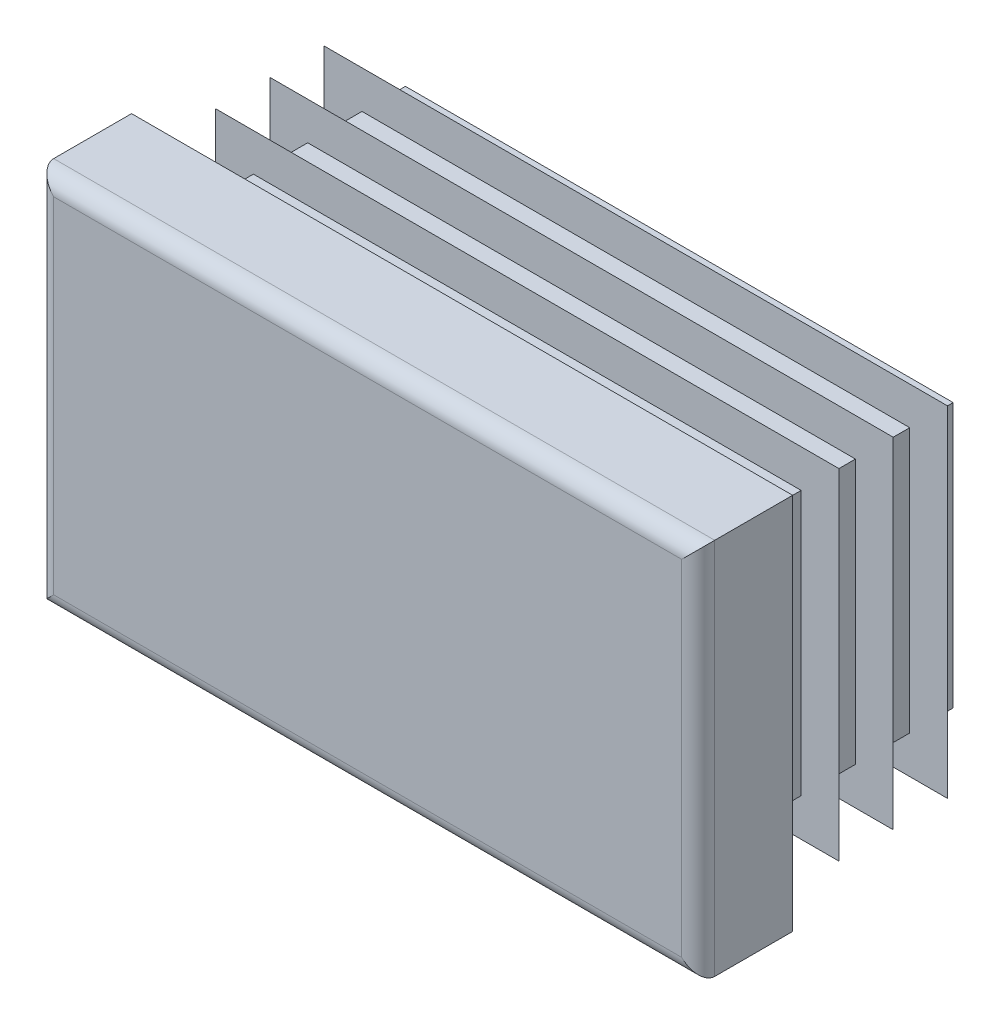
ISO-10303-21;
HEADER;
FILE_DESCRIPTION(('STEP AP214'),'2;1');
FILE_NAME('part.step','',(''),(''),'','','');
FILE_SCHEMA(('AUTOMOTIVE_DESIGN { 1 0 10303 214 1 1 1 1 }'));
ENDSEC;
DATA;
#1=APPLICATION_CONTEXT('core data for automotive mechanical design processes');
#2=APPLICATION_PROTOCOL_DEFINITION('international standard','automotive_design',2000,#1);
#3=PRODUCT_CONTEXT('',#1,'mechanical');
#4=PRODUCT('Part','Part','',(#3));
#5=PRODUCT_RELATED_PRODUCT_CATEGORY('part','',(#4));
#6=PRODUCT_DEFINITION_FORMATION('','',#4);
#7=PRODUCT_DEFINITION_CONTEXT('part definition',#1,'design');
#8=PRODUCT_DEFINITION('design','',#6,#7);
#9=PRODUCT_DEFINITION_SHAPE('','',#8);
#10=(LENGTH_UNIT() NAMED_UNIT(*) SI_UNIT(.MILLI.,.METRE.));
#11=(NAMED_UNIT(*) PLANE_ANGLE_UNIT() SI_UNIT($,.RADIAN.));
#12=(NAMED_UNIT(*) SI_UNIT($,.STERADIAN.) SOLID_ANGLE_UNIT());
#13=UNCERTAINTY_MEASURE_WITH_UNIT(LENGTH_MEASURE(1.E-05),#10,'distance_accuracy_value','');
#14=(GEOMETRIC_REPRESENTATION_CONTEXT(3) GLOBAL_UNCERTAINTY_ASSIGNED_CONTEXT((#13)) GLOBAL_UNIT_ASSIGNED_CONTEXT((#10,
#11,#12)) REPRESENTATION_CONTEXT('',''));
#15=CARTESIAN_POINT('',(0.,0.,0.));
#16=DIRECTION('',(0.,0.,1.));
#17=DIRECTION('',(1.,0.,0.));
#18=AXIS2_PLACEMENT_3D('',#15,#16,#17);
#19=CARTESIAN_POINT('',(16.625,-10.,5.));
#20=DIRECTION('',(0.,0.,-1.));
#21=DIRECTION('',(0.,1.,0.));
#22=AXIS2_PLACEMENT_3D('',#19,#20,#21);
#23=PLANE('',#22);
#24=DIRECTION('',(0.,1.,0.));
#25=VECTOR('',#24,1.);
#26=CARTESIAN_POINT('',(-16.625,-10.,5.));
#27=LINE('',#26,#25);
#28=CARTESIAN_POINT('',(-16.625,-9.125,5.));
#29=VERTEX_POINT('',#28);
#30=CARTESIAN_POINT('',(-16.625,9.125,5.));
#31=VERTEX_POINT('',#30);
#32=EDGE_CURVE('E310',#29,#31,#27,.T.);
#33=ORIENTED_EDGE('',*,*,#32,.F.);
#34=DIRECTION('',(-1.,0.,0.));
#35=VECTOR('',#34,1.);
#36=CARTESIAN_POINT('',(17.5,-9.125,5.));
#37=LINE('',#36,#35);
#38=CARTESIAN_POINT('',(16.625,-9.125,5.));
#39=VERTEX_POINT('',#38);
#40=EDGE_CURVE('E482',#39,#29,#37,.T.);
#41=ORIENTED_EDGE('',*,*,#40,.F.);
#42=DIRECTION('',(0.,1.,0.));
#43=VECTOR('',#42,1.);
#44=CARTESIAN_POINT('',(16.625,-10.,5.));
#45=LINE('',#44,#43);
#46=CARTESIAN_POINT('',(16.625,9.125,5.));
#47=VERTEX_POINT('',#46);
#48=EDGE_CURVE('E305',#39,#47,#45,.T.);
#49=ORIENTED_EDGE('',*,*,#48,.T.);
#50=DIRECTION('',(-1.,0.,0.));
#51=VECTOR('',#50,1.);
#52=CARTESIAN_POINT('',(17.5,9.125,5.));
#53=LINE('',#52,#51);
#54=EDGE_CURVE('E630',#47,#31,#53,.T.);
#55=ORIENTED_EDGE('',*,*,#54,.T.);
#56=EDGE_LOOP('',(#33,#41,#49,#55));
#57=FACE_BOUND('',#56,.T.);
#58=ADVANCED_FACE('F14',(#57),#23,.F.);
#59=CARTESIAN_POINT('',(-16.625,-10.,4.125));
#60=DIRECTION('',(0.,1.,0.));
#61=DIRECTION('',(-1.,0.,0.));
#62=AXIS2_PLACEMENT_3D('',#59,#60,#61);
#63=CYLINDRICAL_SURFACE('',#62,0.875);
#64=DIRECTION('',(0.,1.,0.));
#65=VECTOR('',#64,1.);
#66=CARTESIAN_POINT('',(-17.5,-10.,4.125));
#67=LINE('',#66,#65);
#68=CARTESIAN_POINT('',(-17.5,-10.,4.125));
#69=VERTEX_POINT('',#68);
#70=CARTESIAN_POINT('',(-17.5,10.,4.125));
#71=VERTEX_POINT('',#70);
#72=EDGE_CURVE('E402',#69,#71,#67,.T.);
#73=ORIENTED_EDGE('',*,*,#72,.F.);
#74=CARTESIAN_POINT('',(-16.625,-9.125,4.125));
#75=DIRECTION('',(-0.707106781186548,0.707106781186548,0.));
#76=DIRECTION('',(0.707106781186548,0.707106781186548,0.));
#77=AXIS2_PLACEMENT_3D('',#74,#75,#76);
#78=ELLIPSE('',#77,1.23743686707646,0.875);
#79=EDGE_CURVE('E59',#69,#29,#78,.T.);
#80=ORIENTED_EDGE('',*,*,#79,.T.);
#81=ORIENTED_EDGE('',*,*,#32,.T.);
#82=CARTESIAN_POINT('',(-16.625,9.125,4.125));
#83=DIRECTION('',(0.707106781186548,0.707106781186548,0.));
#84=DIRECTION('',(-0.707106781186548,0.707106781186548,0.));
#85=AXIS2_PLACEMENT_3D('',#82,#83,#84);
#86=ELLIPSE('',#85,1.23743686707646,0.875);
#87=EDGE_CURVE('E306',#31,#71,#86,.F.);
#88=ORIENTED_EDGE('',*,*,#87,.T.);
#89=EDGE_LOOP('',(#73,#80,#81,#88));
#90=FACE_BOUND('',#89,.T.);
#91=ADVANCED_FACE('F16',(#90),#63,.T.);
#92=CARTESIAN_POINT('',(-17.5,-10.,4.125));
#93=DIRECTION('',(1.,0.,0.));
#94=DIRECTION('',(0.,1.,0.));
#95=AXIS2_PLACEMENT_3D('',#92,#93,#94);
#96=PLANE('',#95);
#97=DIRECTION('',(0.,0.,-1.));
#98=VECTOR('',#97,1.);
#99=CARTESIAN_POINT('',(-17.5,10.,4.125));
#100=LINE('',#99,#98);
#101=CARTESIAN_POINT('',(-17.5,10.,0.));
#102=VERTEX_POINT('',#101);
#103=EDGE_CURVE('E615',#71,#102,#100,.T.);
#104=ORIENTED_EDGE('',*,*,#103,.T.);
#105=DIRECTION('',(0.,1.,0.));
#106=VECTOR('',#105,1.);
#107=CARTESIAN_POINT('',(-17.5,-10.,0.));
#108=LINE('',#107,#106);
#109=CARTESIAN_POINT('',(-17.5,-10.,0.));
#110=VERTEX_POINT('',#109);
#111=EDGE_CURVE('E400',#110,#102,#108,.T.);
#112=ORIENTED_EDGE('',*,*,#111,.F.);
#113=DIRECTION('',(0.,0.,-1.));
#114=VECTOR('',#113,1.);
#115=CARTESIAN_POINT('',(-17.5,-10.,4.125));
#116=LINE('',#115,#114);
#117=EDGE_CURVE('E616',#69,#110,#116,.T.);
#118=ORIENTED_EDGE('',*,*,#117,.F.);
#119=ORIENTED_EDGE('',*,*,#72,.T.);
#120=EDGE_LOOP('',(#104,#112,#118,#119));
#121=FACE_BOUND('',#120,.T.);
#122=ADVANCED_FACE('F697',(#121),#96,.F.);
#123=CARTESIAN_POINT('',(-14.5,-10.,0.));
#124=DIRECTION('',(1.,0.,0.));
#125=DIRECTION('',(0.,1.,0.));
#126=AXIS2_PLACEMENT_3D('',#123,#124,#125);
#127=PLANE('',#126);
#128=DIRECTION('',(0.,1.,0.));
#129=VECTOR('',#128,1.);
#130=CARTESIAN_POINT('',(-14.5,-10.,0.));
#131=LINE('',#130,#129);
#132=CARTESIAN_POINT('',(-14.5,-7.,0.));
#133=VERTEX_POINT('',#132);
#134=CARTESIAN_POINT('',(-14.5,7.,0.));
#135=VERTEX_POINT('',#134);
#136=EDGE_CURVE('E397',#133,#135,#131,.T.);
#137=ORIENTED_EDGE('',*,*,#136,.T.);
#138=DIRECTION('',(0.,0.,-1.));
#139=VECTOR('',#138,1.);
#140=CARTESIAN_POINT('',(-14.5,7.,0.));
#141=LINE('',#140,#139);
#142=CARTESIAN_POINT('',(-14.5,7.,-0.575));
#143=VERTEX_POINT('',#142);
#144=EDGE_CURVE('E495',#135,#143,#141,.T.);
#145=ORIENTED_EDGE('',*,*,#144,.T.);
#146=DIRECTION('',(0.,1.,0.));
#147=VECTOR('',#146,1.);
#148=CARTESIAN_POINT('',(-14.5,-10.,-0.575));
#149=LINE('',#148,#147);
#150=CARTESIAN_POINT('',(-14.5,-7.,-0.575));
#151=VERTEX_POINT('',#150);
#152=EDGE_CURVE('E394',#151,#143,#149,.T.);
#153=ORIENTED_EDGE('',*,*,#152,.F.);
#154=DIRECTION('',(0.,0.,1.));
#155=VECTOR('',#154,1.);
#156=CARTESIAN_POINT('',(-14.5,-7.,0.));
#157=LINE('',#156,#155);
#158=EDGE_CURVE('E489',#151,#133,#157,.T.);
#159=ORIENTED_EDGE('',*,*,#158,.T.);
#160=EDGE_LOOP('',(#137,#145,#153,#159));
#161=FACE_BOUND('',#160,.T.);
#162=ADVANCED_FACE('F787',(#161),#127,.F.);
#163=CARTESIAN_POINT('',(-16.5,-10.,-0.575));
#164=DIRECTION('',(0.342020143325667,0.,0.939692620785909));
#165=DIRECTION('',(-0.939692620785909,0.,0.342020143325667));
#166=AXIS2_PLACEMENT_3D('',#163,#164,#165);
#167=PLANE('',#166);
#168=DIRECTION('',(0.,1.,0.));
#169=VECTOR('',#168,1.);
#170=CARTESIAN_POINT('',(-16.5,-10.,-0.575));
#171=LINE('',#170,#169);
#172=CARTESIAN_POINT('',(-16.5,-9.,-0.575));
#173=VERTEX_POINT('',#172);
#174=CARTESIAN_POINT('',(-16.5,9.,-0.575));
#175=VERTEX_POINT('',#174);
#176=EDGE_CURVE('E392',#173,#175,#171,.T.);
#177=ORIENTED_EDGE('',*,*,#176,.T.);
#178=DIRECTION('',(0.844349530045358,-0.43889572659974,-0.307318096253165));
#179=VECTOR('',#178,1.);
#180=CARTESIAN_POINT('',(-9.45895339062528,5.34004028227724,-3.13773138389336));
#181=LINE('',#180,#179);
#182=CARTESIAN_POINT('',(-14.5,7.96039327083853,-1.3029404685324));
#183=VERTEX_POINT('',#182);
#184=EDGE_CURVE('E519',#175,#183,#181,.T.);
#185=ORIENTED_EDGE('',*,*,#184,.T.);
#186=DIRECTION('',(0.,1.,0.));
#187=VECTOR('',#186,1.);
#188=CARTESIAN_POINT('',(-14.5,-10.,-1.3029404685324));
#189=LINE('',#188,#187);
#190=CARTESIAN_POINT('',(-14.5,-7.96039327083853,-1.3029404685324));
#191=VERTEX_POINT('',#190);
#192=EDGE_CURVE('E389',#191,#183,#189,.T.);
#193=ORIENTED_EDGE('',*,*,#192,.F.);
#194=DIRECTION('',(-0.844349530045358,-0.43889572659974,0.307318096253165));
#195=VECTOR('',#194,1.);
#196=CARTESIAN_POINT('',(-16.8705814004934,-9.19262945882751,-0.440119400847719));
#197=LINE('',#196,#195);
#198=EDGE_CURVE('E507',#191,#173,#197,.T.);
#199=ORIENTED_EDGE('',*,*,#198,.T.);
#200=EDGE_LOOP('',(#177,#185,#193,#199));
#201=FACE_BOUND('',#200,.T.);
#202=ADVANCED_FACE('F783',(#201),#167,.F.);
#203=CARTESIAN_POINT('',(-14.5,-10.,-1.3029404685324));
#204=DIRECTION('',(1.,0.,0.));
#205=DIRECTION('',(0.,1.,0.));
#206=AXIS2_PLACEMENT_3D('',#203,#204,#205);
#207=PLANE('',#206);
#208=ORIENTED_EDGE('',*,*,#192,.T.);
#209=DIRECTION('',(0.,-0.819152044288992,-0.573576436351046));
#210=VECTOR('',#209,1.);
#211=CARTESIAN_POINT('',(-14.5,-4.09121150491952,-9.74156498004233));
#212=LINE('',#211,#210);
#213=CARTESIAN_POINT('',(-14.5,7.,-1.97541507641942));
#214=VERTEX_POINT('',#213);
#215=EDGE_CURVE('E516',#183,#214,#212,.T.);
#216=ORIENTED_EDGE('',*,*,#215,.T.);
#217=DIRECTION('',(0.,0.,-1.));
#218=VECTOR('',#217,1.);
#219=CARTESIAN_POINT('',(-14.5,7.,-1.3029404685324));
#220=LINE('',#219,#218);
#221=CARTESIAN_POINT('',(-14.5,7.,-3.45));
#222=VERTEX_POINT('',#221);
#223=EDGE_CURVE('E525',#214,#222,#220,.T.);
#224=ORIENTED_EDGE('',*,*,#223,.T.);
#225=DIRECTION('',(0.,1.,0.));
#226=VECTOR('',#225,1.);
#227=CARTESIAN_POINT('',(-14.5,-10.,-3.45));
#228=LINE('',#227,#226);
#229=CARTESIAN_POINT('',(-14.5,-7.,-3.45));
#230=VERTEX_POINT('',#229);
#231=EDGE_CURVE('E386',#230,#222,#228,.T.);
#232=ORIENTED_EDGE('',*,*,#231,.F.);
#233=DIRECTION('',(0.,0.,1.));
#234=VECTOR('',#233,1.);
#235=CARTESIAN_POINT('',(-14.5,-7.,-1.3029404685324));
#236=LINE('',#235,#234);
#237=CARTESIAN_POINT('',(-14.5,-7.,-1.97541507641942));
#238=VERTEX_POINT('',#237);
#239=EDGE_CURVE('E522',#230,#238,#236,.T.);
#240=ORIENTED_EDGE('',*,*,#239,.T.);
#241=DIRECTION('',(0.,-0.819152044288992,0.573576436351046));
#242=VECTOR('',#241,1.);
#243=CARTESIAN_POINT('',(-14.5,-9.32898992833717,-0.344638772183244));
#244=LINE('',#243,#242);
#245=EDGE_CURVE('E504',#238,#191,#244,.T.);
#246=ORIENTED_EDGE('',*,*,#245,.T.);
#247=EDGE_LOOP('',(#208,#216,#224,#232,#240,#246));
#248=FACE_BOUND('',#247,.T.);
#249=ADVANCED_FACE('F779',(#248),#207,.F.);
#250=CARTESIAN_POINT('',(-16.5,-10.,-3.45));
#251=DIRECTION('',(0.342020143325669,0.,0.939692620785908));
#252=DIRECTION('',(-0.939692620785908,0.,0.342020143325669));
#253=AXIS2_PLACEMENT_3D('',#250,#251,#252);
#254=PLANE('',#253);
#255=DIRECTION('',(0.,1.,0.));
#256=VECTOR('',#255,1.);
#257=CARTESIAN_POINT('',(-16.5,-10.,-3.45));
#258=LINE('',#257,#256);
#259=CARTESIAN_POINT('',(-16.5,-9.,-3.45));
#260=VERTEX_POINT('',#259);
#261=CARTESIAN_POINT('',(-16.5,9.,-3.45));
#262=VERTEX_POINT('',#261);
#263=EDGE_CURVE('E384',#260,#262,#258,.T.);
#264=ORIENTED_EDGE('',*,*,#263,.T.);
#265=DIRECTION('',(0.844349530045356,-0.438895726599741,-0.307318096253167));
#266=VECTOR('',#265,1.);
#267=CARTESIAN_POINT('',(-9.45895339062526,5.34004028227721,-6.01273138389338));
#268=LINE('',#267,#266);
#269=CARTESIAN_POINT('',(-14.5,7.96039327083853,-4.1779404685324));
#270=VERTEX_POINT('',#269);
#271=EDGE_CURVE('E549',#262,#270,#268,.T.);
#272=ORIENTED_EDGE('',*,*,#271,.T.);
#273=DIRECTION('',(0.,1.,0.));
#274=VECTOR('',#273,1.);
#275=CARTESIAN_POINT('',(-14.5,-10.,-4.1779404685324));
#276=LINE('',#275,#274);
#277=CARTESIAN_POINT('',(-14.5,-7.96039327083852,-4.1779404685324));
#278=VERTEX_POINT('',#277);
#279=EDGE_CURVE('E381',#278,#270,#276,.T.);
#280=ORIENTED_EDGE('',*,*,#279,.F.);
#281=DIRECTION('',(-0.844349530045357,-0.438895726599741,0.307318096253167));
#282=VECTOR('',#281,1.);
#283=CARTESIAN_POINT('',(-16.8705814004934,-9.19262945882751,-3.31511940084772));
#284=LINE('',#283,#282);
#285=EDGE_CURVE('E537',#278,#260,#284,.T.);
#286=ORIENTED_EDGE('',*,*,#285,.T.);
#287=EDGE_LOOP('',(#264,#272,#280,#286));
#288=FACE_BOUND('',#287,.T.);
#289=ADVANCED_FACE('F775',(#288),#254,.F.);
#290=CARTESIAN_POINT('',(-14.5,-10.,-4.1779404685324));
#291=DIRECTION('',(1.,0.,0.));
#292=DIRECTION('',(0.,1.,0.));
#293=AXIS2_PLACEMENT_3D('',#290,#291,#292);
#294=PLANE('',#293);
#295=ORIENTED_EDGE('',*,*,#279,.T.);
#296=DIRECTION('',(0.,-0.819152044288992,-0.573576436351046));
#297=VECTOR('',#296,1.);
#298=CARTESIAN_POINT('',(-14.5,-4.09121150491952,-12.6165649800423));
#299=LINE('',#298,#297);
#300=CARTESIAN_POINT('',(-14.5,7.,-4.85041507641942));
#301=VERTEX_POINT('',#300);
#302=EDGE_CURVE('E546',#270,#301,#299,.T.);
#303=ORIENTED_EDGE('',*,*,#302,.T.);
#304=DIRECTION('',(0.,0.,-1.));
#305=VECTOR('',#304,1.);
#306=CARTESIAN_POINT('',(-14.5,7.,-4.1779404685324));
#307=LINE('',#306,#305);
#308=CARTESIAN_POINT('',(-14.5,7.,-6.325));
#309=VERTEX_POINT('',#308);
#310=EDGE_CURVE('E555',#301,#309,#307,.T.);
#311=ORIENTED_EDGE('',*,*,#310,.T.);
#312=DIRECTION('',(0.,1.,0.));
#313=VECTOR('',#312,1.);
#314=CARTESIAN_POINT('',(-14.5,-10.,-6.325));
#315=LINE('',#314,#313);
#316=CARTESIAN_POINT('',(-14.5,-7.,-6.325));
#317=VERTEX_POINT('',#316);
#318=EDGE_CURVE('E378',#317,#309,#315,.T.);
#319=ORIENTED_EDGE('',*,*,#318,.F.);
#320=DIRECTION('',(0.,0.,1.));
#321=VECTOR('',#320,1.);
#322=CARTESIAN_POINT('',(-14.5,-7.,-4.1779404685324));
#323=LINE('',#322,#321);
#324=CARTESIAN_POINT('',(-14.5,-7.,-4.85041507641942));
#325=VERTEX_POINT('',#324);
#326=EDGE_CURVE('E552',#317,#325,#323,.T.);
#327=ORIENTED_EDGE('',*,*,#326,.T.);
#328=DIRECTION('',(0.,-0.819152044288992,0.573576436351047));
#329=VECTOR('',#328,1.);
#330=CARTESIAN_POINT('',(-14.5,-9.32898992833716,-3.21963877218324));
#331=LINE('',#330,#329);
#332=EDGE_CURVE('E534',#325,#278,#331,.T.);
#333=ORIENTED_EDGE('',*,*,#332,.T.);
#334=EDGE_LOOP('',(#295,#303,#311,#319,#327,#333));
#335=FACE_BOUND('',#334,.T.);
#336=ADVANCED_FACE('F771',(#335),#294,.F.);
#337=CARTESIAN_POINT('',(-16.5,-10.,-6.325));
#338=DIRECTION('',(0.342020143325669,0.,0.939692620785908));
#339=DIRECTION('',(-0.939692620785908,0.,0.342020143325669));
#340=AXIS2_PLACEMENT_3D('',#337,#338,#339);
#341=PLANE('',#340);
#342=DIRECTION('',(0.,1.,0.));
#343=VECTOR('',#342,1.);
#344=CARTESIAN_POINT('',(-16.5,-10.,-6.325));
#345=LINE('',#344,#343);
#346=CARTESIAN_POINT('',(-16.5,-9.,-6.325));
#347=VERTEX_POINT('',#346);
#348=CARTESIAN_POINT('',(-16.5,9.,-6.325));
#349=VERTEX_POINT('',#348);
#350=EDGE_CURVE('E376',#347,#349,#345,.T.);
#351=ORIENTED_EDGE('',*,*,#350,.T.);
#352=DIRECTION('',(0.844349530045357,-0.438895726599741,-0.307318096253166));
#353=VECTOR('',#352,1.);
#354=CARTESIAN_POINT('',(-9.45895339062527,5.34004028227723,-8.88773138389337));
#355=LINE('',#354,#353);
#356=CARTESIAN_POINT('',(-14.5,7.96039327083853,-7.0529404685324));
#357=VERTEX_POINT('',#356);
#358=EDGE_CURVE('E579',#349,#357,#355,.T.);
#359=ORIENTED_EDGE('',*,*,#358,.T.);
#360=DIRECTION('',(0.,1.,0.));
#361=VECTOR('',#360,1.);
#362=CARTESIAN_POINT('',(-14.5,-10.,-7.0529404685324));
#363=LINE('',#362,#361);
#364=CARTESIAN_POINT('',(-14.5,-7.96039327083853,-7.0529404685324));
#365=VERTEX_POINT('',#364);
#366=EDGE_CURVE('E373',#365,#357,#363,.T.);
#367=ORIENTED_EDGE('',*,*,#366,.F.);
#368=DIRECTION('',(-0.844349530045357,-0.438895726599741,0.307318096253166));
#369=VECTOR('',#368,1.);
#370=CARTESIAN_POINT('',(-16.8705814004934,-9.19262945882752,-6.19011940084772));
#371=LINE('',#370,#369);
#372=EDGE_CURVE('E567',#365,#347,#371,.T.);
#373=ORIENTED_EDGE('',*,*,#372,.T.);
#374=EDGE_LOOP('',(#351,#359,#367,#373));
#375=FACE_BOUND('',#374,.T.);
#376=ADVANCED_FACE('F767',(#375),#341,.F.);
#377=CARTESIAN_POINT('',(-14.5,-10.,-7.0529404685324));
#378=DIRECTION('',(1.,0.,0.));
#379=DIRECTION('',(0.,1.,0.));
#380=AXIS2_PLACEMENT_3D('',#377,#378,#379);
#381=PLANE('',#380);
#382=ORIENTED_EDGE('',*,*,#366,.T.);
#383=DIRECTION('',(0.,-0.819152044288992,-0.573576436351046));
#384=VECTOR('',#383,1.);
#385=CARTESIAN_POINT('',(-14.5,-4.09121150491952,-15.4915649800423));
#386=LINE('',#385,#384);
#387=CARTESIAN_POINT('',(-14.5,7.,-7.72541507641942));
#388=VERTEX_POINT('',#387);
#389=EDGE_CURVE('E576',#357,#388,#386,.T.);
#390=ORIENTED_EDGE('',*,*,#389,.T.);
#391=DIRECTION('',(0.,0.,-1.));
#392=VECTOR('',#391,1.);
#393=CARTESIAN_POINT('',(-14.5,7.,-7.0529404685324));
#394=LINE('',#393,#392);
#395=CARTESIAN_POINT('',(-14.5,7.,-9.2));
#396=VERTEX_POINT('',#395);
#397=EDGE_CURVE('E585',#388,#396,#394,.T.);
#398=ORIENTED_EDGE('',*,*,#397,.T.);
#399=DIRECTION('',(0.,1.,0.));
#400=VECTOR('',#399,1.);
#401=CARTESIAN_POINT('',(-14.5,-10.,-9.2));
#402=LINE('',#401,#400);
#403=CARTESIAN_POINT('',(-14.5,-7.,-9.2));
#404=VERTEX_POINT('',#403);
#405=EDGE_CURVE('E370',#404,#396,#402,.T.);
#406=ORIENTED_EDGE('',*,*,#405,.F.);
#407=DIRECTION('',(0.,0.,1.));
#408=VECTOR('',#407,1.);
#409=CARTESIAN_POINT('',(-14.5,-7.,-7.0529404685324));
#410=LINE('',#409,#408);
#411=CARTESIAN_POINT('',(-14.5,-7.,-7.72541507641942));
#412=VERTEX_POINT('',#411);
#413=EDGE_CURVE('E582',#404,#412,#410,.T.);
#414=ORIENTED_EDGE('',*,*,#413,.T.);
#415=DIRECTION('',(0.,-0.819152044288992,0.573576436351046));
#416=VECTOR('',#415,1.);
#417=CARTESIAN_POINT('',(-14.5,-9.32898992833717,-6.09463877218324));
#418=LINE('',#417,#416);
#419=EDGE_CURVE('E564',#412,#365,#418,.T.);
#420=ORIENTED_EDGE('',*,*,#419,.T.);
#421=EDGE_LOOP('',(#382,#390,#398,#406,#414,#420));
#422=FACE_BOUND('',#421,.T.);
#423=ADVANCED_FACE('F764',(#422),#381,.F.);
#424=CARTESIAN_POINT('',(-16.5,-10.,-9.2));
#425=DIRECTION('',(0.342020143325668,0.,0.939692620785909));
#426=DIRECTION('',(-0.939692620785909,0.,0.342020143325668));
#427=AXIS2_PLACEMENT_3D('',#424,#425,#426);
#428=PLANE('',#427);
#429=DIRECTION('',(0.,1.,0.));
#430=VECTOR('',#429,1.);
#431=CARTESIAN_POINT('',(-16.5,-10.,-9.2));
#432=LINE('',#431,#430);
#433=CARTESIAN_POINT('',(-16.5,-9.,-9.2));
#434=VERTEX_POINT('',#433);
#435=CARTESIAN_POINT('',(-16.5,9.,-9.2));
#436=VERTEX_POINT('',#435);
#437=EDGE_CURVE('E368',#434,#436,#432,.T.);
#438=ORIENTED_EDGE('',*,*,#437,.T.);
#439=DIRECTION('',(0.844349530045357,-0.438895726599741,-0.307318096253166));
#440=VECTOR('',#439,1.);
#441=CARTESIAN_POINT('',(-9.45895339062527,5.34004028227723,-11.7627313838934));
#442=LINE('',#441,#440);
#443=CARTESIAN_POINT('',(-14.5,7.96039327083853,-9.9279404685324));
#444=VERTEX_POINT('',#443);
#445=EDGE_CURVE('E607',#436,#444,#442,.T.);
#446=ORIENTED_EDGE('',*,*,#445,.T.);
#447=DIRECTION('',(0.,1.,0.));
#448=VECTOR('',#447,1.);
#449=CARTESIAN_POINT('',(-14.5,-10.,-9.9279404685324));
#450=LINE('',#449,#448);
#451=CARTESIAN_POINT('',(-14.5,-7.96039327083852,-9.9279404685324));
#452=VERTEX_POINT('',#451);
#453=EDGE_CURVE('E365',#452,#444,#450,.T.);
#454=ORIENTED_EDGE('',*,*,#453,.F.);
#455=DIRECTION('',(-0.844349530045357,-0.438895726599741,0.307318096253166));
#456=VECTOR('',#455,1.);
#457=CARTESIAN_POINT('',(-16.8705814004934,-9.19262945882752,-9.06511940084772));
#458=LINE('',#457,#456);
#459=EDGE_CURVE('E595',#452,#434,#458,.T.);
#460=ORIENTED_EDGE('',*,*,#459,.T.);
#461=EDGE_LOOP('',(#438,#446,#454,#460));
#462=FACE_BOUND('',#461,.T.);
#463=ADVANCED_FACE('F675',(#462),#428,.F.);
#464=CARTESIAN_POINT('',(-14.5,-10.,-9.9279404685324));
#465=DIRECTION('',(1.,0.,0.));
#466=DIRECTION('',(0.,1.,0.));
#467=AXIS2_PLACEMENT_3D('',#464,#465,#466);
#468=PLANE('',#467);
#469=ORIENTED_EDGE('',*,*,#453,.T.);
#470=DIRECTION('',(0.,-0.819152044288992,-0.573576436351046));
#471=VECTOR('',#470,1.);
#472=CARTESIAN_POINT('',(-14.5,-4.09121150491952,-18.3665649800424));
#473=LINE('',#472,#471);
#474=CARTESIAN_POINT('',(-14.5,7.,-10.6004150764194));
#475=VERTEX_POINT('',#474);
#476=EDGE_CURVE('E604',#444,#475,#473,.T.);
#477=ORIENTED_EDGE('',*,*,#476,.T.);
#478=DIRECTION('',(0.,0.,-1.));
#479=VECTOR('',#478,1.);
#480=CARTESIAN_POINT('',(-14.5,7.,-9.9279404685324));
#481=LINE('',#480,#479);
#482=CARTESIAN_POINT('',(-14.5,7.,-11.5));
#483=VERTEX_POINT('',#482);
#484=EDGE_CURVE('E613',#475,#483,#481,.T.);
#485=ORIENTED_EDGE('',*,*,#484,.T.);
#486=DIRECTION('',(0.,1.,0.));
#487=VECTOR('',#486,1.);
#488=CARTESIAN_POINT('',(-14.5,-10.,-11.5));
#489=LINE('',#488,#487);
#490=CARTESIAN_POINT('',(-14.5,-7.,-11.5));
#491=VERTEX_POINT('',#490);
#492=EDGE_CURVE('E362',#491,#483,#489,.T.);
#493=ORIENTED_EDGE('',*,*,#492,.F.);
#494=DIRECTION('',(0.,0.,1.));
#495=VECTOR('',#494,1.);
#496=CARTESIAN_POINT('',(-14.5,-7.,-9.9279404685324));
#497=LINE('',#496,#495);
#498=CARTESIAN_POINT('',(-14.5,-7.,-10.6004150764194));
#499=VERTEX_POINT('',#498);
#500=EDGE_CURVE('E610',#491,#499,#497,.T.);
#501=ORIENTED_EDGE('',*,*,#500,.T.);
#502=DIRECTION('',(0.,-0.819152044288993,0.573576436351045));
#503=VECTOR('',#502,1.);
#504=CARTESIAN_POINT('',(-14.5,-9.32898992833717,-8.96963877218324));
#505=LINE('',#504,#503);
#506=EDGE_CURVE('E592',#499,#452,#505,.T.);
#507=ORIENTED_EDGE('',*,*,#506,.T.);
#508=EDGE_LOOP('',(#469,#477,#485,#493,#501,#507));
#509=FACE_BOUND('',#508,.T.);
#510=ADVANCED_FACE('F677',(#509),#468,.F.);
#511=CARTESIAN_POINT('',(-14.5,-10.,-11.5));
#512=DIRECTION('',(0.,0.,1.));
#513=DIRECTION('',(0.,-1.,0.));
#514=AXIS2_PLACEMENT_3D('',#511,#512,#513);
#515=PLANE('',#514);
#516=ORIENTED_EDGE('',*,*,#492,.T.);
#517=DIRECTION('',(-1.,0.,0.));
#518=VECTOR('',#517,1.);
#519=CARTESIAN_POINT('',(17.5,7.,-11.5));
#520=LINE('',#519,#518);
#521=CARTESIAN_POINT('',(14.5,7.,-11.5));
#522=VERTEX_POINT('',#521);
#523=EDGE_CURVE('E438',#522,#483,#520,.T.);
#524=ORIENTED_EDGE('',*,*,#523,.F.);
#525=DIRECTION('',(0.,1.,0.));
#526=VECTOR('',#525,1.);
#527=CARTESIAN_POINT('',(14.5,-10.,-11.5));
#528=LINE('',#527,#526);
#529=CARTESIAN_POINT('',(14.5,-7.,-11.5));
#530=VERTEX_POINT('',#529);
#531=EDGE_CURVE('E359',#530,#522,#528,.T.);
#532=ORIENTED_EDGE('',*,*,#531,.F.);
#533=DIRECTION('',(-1.,0.,0.));
#534=VECTOR('',#533,1.);
#535=CARTESIAN_POINT('',(17.5,-7.,-11.5));
#536=LINE('',#535,#534);
#537=EDGE_CURVE('E436',#530,#491,#536,.T.);
#538=ORIENTED_EDGE('',*,*,#537,.T.);
#539=EDGE_LOOP('',(#516,#524,#532,#538));
#540=FACE_BOUND('',#539,.T.);
#541=ADVANCED_FACE('F435',(#540),#515,.F.);
#542=CARTESIAN_POINT('',(14.5,-10.,-11.5));
#543=DIRECTION('',(-1.,0.,0.));
#544=DIRECTION('',(0.,-1.,0.));
#545=AXIS2_PLACEMENT_3D('',#542,#543,#544);
#546=PLANE('',#545);
#547=DIRECTION('',(0.,0.,1.));
#548=VECTOR('',#547,1.);
#549=CARTESIAN_POINT('',(14.5,7.,-11.5));
#550=LINE('',#549,#548);
#551=CARTESIAN_POINT('',(14.5,7.,-10.6004150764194));
#552=VERTEX_POINT('',#551);
#553=EDGE_CURVE('E9',#522,#552,#550,.T.);
#554=ORIENTED_EDGE('',*,*,#553,.T.);
#555=DIRECTION('',(0.,0.819152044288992,0.573576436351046));
#556=VECTOR('',#555,1.);
#557=CARTESIAN_POINT('',(14.5,-4.82983787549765,-18.8837567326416));
#558=LINE('',#557,#556);
#559=CARTESIAN_POINT('',(14.5,7.96039327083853,-9.9279404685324));
#560=VERTEX_POINT('',#559);
#561=EDGE_CURVE('E601',#552,#560,#558,.T.);
#562=ORIENTED_EDGE('',*,*,#561,.T.);
#563=DIRECTION('',(0.,1.,0.));
#564=VECTOR('',#563,1.);
#565=CARTESIAN_POINT('',(14.5,-10.,-9.9279404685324));
#566=LINE('',#565,#564);
#567=CARTESIAN_POINT('',(14.5,-7.96039327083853,-9.9279404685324));
#568=VERTEX_POINT('',#567);
#569=EDGE_CURVE('E356',#568,#560,#566,.T.);
#570=ORIENTED_EDGE('',*,*,#569,.F.);
#571=DIRECTION('',(0.,0.819152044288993,-0.573576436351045));
#572=VECTOR('',#571,1.);
#573=CARTESIAN_POINT('',(14.5,-8.59036355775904,-9.48683052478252));
#574=LINE('',#573,#572);
#575=CARTESIAN_POINT('',(14.5,-7.,-10.6004150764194));
#576=VERTEX_POINT('',#575);
#577=EDGE_CURVE('E428',#568,#576,#574,.T.);
#578=ORIENTED_EDGE('',*,*,#577,.T.);
#579=DIRECTION('',(0.,0.,-1.));
#580=VECTOR('',#579,1.);
#581=CARTESIAN_POINT('',(14.5,-7.,-11.5));
#582=LINE('',#581,#580);
#583=EDGE_CURVE('E23',#576,#530,#582,.T.);
#584=ORIENTED_EDGE('',*,*,#583,.T.);
#585=ORIENTED_EDGE('',*,*,#531,.T.);
#586=EDGE_LOOP('',(#554,#562,#570,#578,#584,#585));
#587=FACE_BOUND('',#586,.T.);
#588=ADVANCED_FACE('F426',(#587),#546,.F.);
#589=CARTESIAN_POINT('',(14.5,-10.,-9.9279404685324));
#590=DIRECTION('',(-0.342020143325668,0.,0.939692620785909));
#591=DIRECTION('',(-0.939692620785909,0.,-0.342020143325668));
#592=AXIS2_PLACEMENT_3D('',#589,#590,#591);
#593=PLANE('',#592);
#594=ORIENTED_EDGE('',*,*,#569,.T.);
#595=DIRECTION('',(0.844349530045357,0.438895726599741,0.307318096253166));
#596=VECTOR('',#595,1.);
#597=CARTESIAN_POINT('',(7.8442123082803,4.50069243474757,-12.3504490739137));
#598=LINE('',#597,#596);
#599=CARTESIAN_POINT('',(16.5,9.,-9.2));
#600=VERTEX_POINT('',#599);
#601=EDGE_CURVE('E598',#560,#600,#598,.T.);
#602=ORIENTED_EDGE('',*,*,#601,.T.);
#603=DIRECTION('',(0.,1.,0.));
#604=VECTOR('',#603,1.);
#605=CARTESIAN_POINT('',(16.5,-10.,-9.2));
#606=LINE('',#605,#604);
#607=CARTESIAN_POINT('',(16.5,-9.,-9.2));
#608=VERTEX_POINT('',#607);
#609=EDGE_CURVE('E353',#608,#600,#606,.T.);
#610=ORIENTED_EDGE('',*,*,#609,.F.);
#611=DIRECTION('',(-0.844349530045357,0.438895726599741,-0.307318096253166));
#612=VECTOR('',#611,1.);
#613=CARTESIAN_POINT('',(15.2558403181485,-8.35328161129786,-9.65283709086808));
#614=LINE('',#613,#612);
#615=EDGE_CURVE('E588',#608,#568,#614,.T.);
#616=ORIENTED_EDGE('',*,*,#615,.T.);
#617=EDGE_LOOP('',(#594,#602,#610,#616));
#618=FACE_BOUND('',#617,.T.);
#619=ADVANCED_FACE('F752',(#618),#593,.F.);
#620=CARTESIAN_POINT('',(16.5,-10.,-9.2));
#621=DIRECTION('',(0.,0.,-1.));
#622=DIRECTION('',(0.,1.,0.));
#623=AXIS2_PLACEMENT_3D('',#620,#621,#622);
#624=PLANE('',#623);
#625=ORIENTED_EDGE('',*,*,#609,.T.);
#626=DIRECTION('',(-1.,0.,0.));
#627=VECTOR('',#626,1.);
#628=CARTESIAN_POINT('',(17.5,9.,-9.2));
#629=LINE('',#628,#627);
#630=EDGE_CURVE('E444',#600,#436,#629,.T.);
#631=ORIENTED_EDGE('',*,*,#630,.T.);
#632=ORIENTED_EDGE('',*,*,#437,.F.);
#633=DIRECTION('',(-1.,0.,0.));
#634=VECTOR('',#633,1.);
#635=CARTESIAN_POINT('',(17.5,-9.,-9.2));
#636=LINE('',#635,#634);
#637=EDGE_CURVE('E451',#608,#434,#636,.T.);
#638=ORIENTED_EDGE('',*,*,#637,.F.);
#639=EDGE_LOOP('',(#625,#631,#632,#638));
#640=FACE_BOUND('',#639,.T.);
#641=ORIENTED_EDGE('',*,*,#405,.T.);
#642=DIRECTION('',(-1.,0.,0.));
#643=VECTOR('',#642,1.);
#644=CARTESIAN_POINT('',(17.5,7.,-9.2));
#645=LINE('',#644,#643);
#646=CARTESIAN_POINT('',(14.5,7.,-9.2));
#647=VERTEX_POINT('',#646);
#648=EDGE_CURVE('E663',#647,#396,#645,.T.);
#649=ORIENTED_EDGE('',*,*,#648,.F.);
#650=DIRECTION('',(0.,1.,0.));
#651=VECTOR('',#650,1.);
#652=CARTESIAN_POINT('',(14.5,-10.,-9.2));
#653=LINE('',#652,#651);
#654=CARTESIAN_POINT('',(14.5,-7.,-9.2));
#655=VERTEX_POINT('',#654);
#656=EDGE_CURVE('E350',#655,#647,#653,.T.);
#657=ORIENTED_EDGE('',*,*,#656,.F.);
#658=DIRECTION('',(-1.,0.,0.));
#659=VECTOR('',#658,1.);
#660=CARTESIAN_POINT('',(17.5,-7.,-9.2));
#661=LINE('',#660,#659);
#662=EDGE_CURVE('E453',#655,#404,#661,.T.);
#663=ORIENTED_EDGE('',*,*,#662,.T.);
#664=EDGE_LOOP('',(#641,#649,#657,#663));
#665=FACE_BOUND('',#664,.T.);
#666=ADVANCED_FACE('F667',(#640,#665),#624,.F.);
#667=CARTESIAN_POINT('',(14.5,-10.,-9.2));
#668=DIRECTION('',(-1.,0.,0.));
#669=DIRECTION('',(0.,-1.,0.));
#670=AXIS2_PLACEMENT_3D('',#667,#668,#669);
#671=PLANE('',#670);
#672=DIRECTION('',(0.,0.,1.));
#673=VECTOR('',#672,1.);
#674=CARTESIAN_POINT('',(14.5,7.,-9.2));
#675=LINE('',#674,#673);
#676=CARTESIAN_POINT('',(14.5,7.,-7.72541507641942));
#677=VERTEX_POINT('',#676);
#678=EDGE_CURVE('E420',#647,#677,#675,.T.);
#679=ORIENTED_EDGE('',*,*,#678,.T.);
#680=DIRECTION('',(0.,0.819152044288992,0.573576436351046));
#681=VECTOR('',#680,1.);
#682=CARTESIAN_POINT('',(14.5,-5.0999995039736,-16.1979259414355));
#683=LINE('',#682,#681);
#684=CARTESIAN_POINT('',(14.5,7.96039327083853,-7.05294046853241));
#685=VERTEX_POINT('',#684);
#686=EDGE_CURVE('E573',#677,#685,#683,.T.);
#687=ORIENTED_EDGE('',*,*,#686,.T.);
#688=DIRECTION('',(0.,1.,0.));
#689=VECTOR('',#688,1.);
#690=CARTESIAN_POINT('',(14.5,-10.,-7.05294046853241));
#691=LINE('',#690,#689);
#692=CARTESIAN_POINT('',(14.5,-7.96039327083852,-7.05294046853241));
#693=VERTEX_POINT('',#692);
#694=EDGE_CURVE('E347',#693,#685,#691,.T.);
#695=ORIENTED_EDGE('',*,*,#694,.F.);
#696=DIRECTION('',(0.,0.819152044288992,-0.573576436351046));
#697=VECTOR('',#696,1.);
#698=CARTESIAN_POINT('',(14.5,-8.32020192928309,-6.8009997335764));
#699=LINE('',#698,#697);
#700=CARTESIAN_POINT('',(14.5,-7.,-7.72541507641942));
#701=VERTEX_POINT('',#700);
#702=EDGE_CURVE('E561',#693,#701,#699,.T.);
#703=ORIENTED_EDGE('',*,*,#702,.T.);
#704=DIRECTION('',(0.,0.,-1.));
#705=VECTOR('',#704,1.);
#706=CARTESIAN_POINT('',(14.5,-7.,-9.2));
#707=LINE('',#706,#705);
#708=EDGE_CURVE('E417',#701,#655,#707,.T.);
#709=ORIENTED_EDGE('',*,*,#708,.T.);
#710=ORIENTED_EDGE('',*,*,#656,.T.);
#711=EDGE_LOOP('',(#679,#687,#695,#703,#709,#710));
#712=FACE_BOUND('',#711,.T.);
#713=ADVANCED_FACE('F745',(#712),#671,.F.);
#714=CARTESIAN_POINT('',(14.5,-10.,-7.05294046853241));
#715=DIRECTION('',(-0.342020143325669,0.,0.939692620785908));
#716=DIRECTION('',(-0.939692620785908,0.,-0.342020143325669));
#717=AXIS2_PLACEMENT_3D('',#714,#715,#716);
#718=PLANE('',#717);
#719=ORIENTED_EDGE('',*,*,#694,.T.);
#720=DIRECTION('',(0.844349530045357,0.438895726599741,0.307318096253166));
#721=VECTOR('',#720,1.);
#722=CARTESIAN_POINT('',(7.8442123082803,4.50069243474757,-9.47544907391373));
#723=LINE('',#722,#721);
#724=CARTESIAN_POINT('',(16.5,9.,-6.325));
#725=VERTEX_POINT('',#724);
#726=EDGE_CURVE('E570',#685,#725,#723,.T.);
#727=ORIENTED_EDGE('',*,*,#726,.T.);
#728=DIRECTION('',(0.,1.,0.));
#729=VECTOR('',#728,1.);
#730=CARTESIAN_POINT('',(16.5,-10.,-6.325));
#731=LINE('',#730,#729);
#732=CARTESIAN_POINT('',(16.5,-9.,-6.325));
#733=VERTEX_POINT('',#732);
#734=EDGE_CURVE('E344',#733,#725,#731,.T.);
#735=ORIENTED_EDGE('',*,*,#734,.F.);
#736=DIRECTION('',(-0.844349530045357,0.438895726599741,-0.307318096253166));
#737=VECTOR('',#736,1.);
#738=CARTESIAN_POINT('',(15.2558403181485,-8.35328161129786,-6.77783709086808));
#739=LINE('',#738,#737);
#740=EDGE_CURVE('E558',#733,#693,#739,.T.);
#741=ORIENTED_EDGE('',*,*,#740,.T.);
#742=EDGE_LOOP('',(#719,#727,#735,#741));
#743=FACE_BOUND('',#742,.T.);
#744=ADVANCED_FACE('F741',(#743),#718,.F.);
#745=CARTESIAN_POINT('',(16.5,-10.,-6.325));
#746=DIRECTION('',(0.,0.,-1.));
#747=DIRECTION('',(0.,1.,0.));
#748=AXIS2_PLACEMENT_3D('',#745,#746,#747);
#749=PLANE('',#748);
#750=ORIENTED_EDGE('',*,*,#734,.T.);
#751=DIRECTION('',(-1.,0.,0.));
#752=VECTOR('',#751,1.);
#753=CARTESIAN_POINT('',(17.5,9.,-6.325));
#754=LINE('',#753,#752);
#755=EDGE_CURVE('E657',#725,#349,#754,.T.);
#756=ORIENTED_EDGE('',*,*,#755,.T.);
#757=ORIENTED_EDGE('',*,*,#350,.F.);
#758=DIRECTION('',(-1.,0.,0.));
#759=VECTOR('',#758,1.);
#760=CARTESIAN_POINT('',(17.5,-9.,-6.325));
#761=LINE('',#760,#759);
#762=EDGE_CURVE('E459',#733,#347,#761,.T.);
#763=ORIENTED_EDGE('',*,*,#762,.F.);
#764=EDGE_LOOP('',(#750,#756,#757,#763));
#765=FACE_BOUND('',#764,.T.);
#766=ORIENTED_EDGE('',*,*,#318,.T.);
#767=DIRECTION('',(-1.,0.,0.));
#768=VECTOR('',#767,1.);
#769=CARTESIAN_POINT('',(17.5,7.,-6.325));
#770=LINE('',#769,#768);
#771=CARTESIAN_POINT('',(14.5,7.,-6.325));
#772=VERTEX_POINT('',#771);
#773=EDGE_CURVE('E655',#772,#309,#770,.T.);
#774=ORIENTED_EDGE('',*,*,#773,.F.);
#775=DIRECTION('',(0.,1.,0.));
#776=VECTOR('',#775,1.);
#777=CARTESIAN_POINT('',(14.5,-10.,-6.325));
#778=LINE('',#777,#776);
#779=CARTESIAN_POINT('',(14.5,-7.,-6.325));
#780=VERTEX_POINT('',#779);
#781=EDGE_CURVE('E341',#780,#772,#778,.T.);
#782=ORIENTED_EDGE('',*,*,#781,.F.);
#783=DIRECTION('',(-1.,0.,0.));
#784=VECTOR('',#783,1.);
#785=CARTESIAN_POINT('',(17.5,-7.,-6.325));
#786=LINE('',#785,#784);
#787=EDGE_CURVE('E461',#780,#317,#786,.T.);
#788=ORIENTED_EDGE('',*,*,#787,.T.);
#789=EDGE_LOOP('',(#766,#774,#782,#788));
#790=FACE_BOUND('',#789,.T.);
#791=ADVANCED_FACE('F737',(#765,#790),#749,.F.);
#792=CARTESIAN_POINT('',(14.5,-10.,-6.325));
#793=DIRECTION('',(-1.,0.,0.));
#794=DIRECTION('',(0.,-1.,0.));
#795=AXIS2_PLACEMENT_3D('',#792,#793,#794);
#796=PLANE('',#795);
#797=DIRECTION('',(0.,0.,1.));
#798=VECTOR('',#797,1.);
#799=CARTESIAN_POINT('',(14.5,7.,-6.325));
#800=LINE('',#799,#798);
#801=CARTESIAN_POINT('',(14.5,7.,-4.85041507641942));
#802=VERTEX_POINT('',#801);
#803=EDGE_CURVE('E414',#772,#802,#800,.T.);
#804=ORIENTED_EDGE('',*,*,#803,.T.);
#805=DIRECTION('',(0.,0.819152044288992,0.573576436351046));
#806=VECTOR('',#805,1.);
#807=CARTESIAN_POINT('',(14.5,-5.0999995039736,-13.3229259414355));
#808=LINE('',#807,#806);
#809=CARTESIAN_POINT('',(14.5,7.96039327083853,-4.1779404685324));
#810=VERTEX_POINT('',#809);
#811=EDGE_CURVE('E543',#802,#810,#808,.T.);
#812=ORIENTED_EDGE('',*,*,#811,.T.);
#813=DIRECTION('',(0.,1.,0.));
#814=VECTOR('',#813,1.);
#815=CARTESIAN_POINT('',(14.5,-10.,-4.1779404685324));
#816=LINE('',#815,#814);
#817=CARTESIAN_POINT('',(14.5,-7.96039327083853,-4.1779404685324));
#818=VERTEX_POINT('',#817);
#819=EDGE_CURVE('E338',#818,#810,#816,.T.);
#820=ORIENTED_EDGE('',*,*,#819,.F.);
#821=DIRECTION('',(0.,0.819152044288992,-0.573576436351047));
#822=VECTOR('',#821,1.);
#823=CARTESIAN_POINT('',(14.5,-8.32020192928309,-3.9259997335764));
#824=LINE('',#823,#822);
#825=CARTESIAN_POINT('',(14.5,-7.,-4.85041507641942));
#826=VERTEX_POINT('',#825);
#827=EDGE_CURVE('E531',#818,#826,#824,.T.);
#828=ORIENTED_EDGE('',*,*,#827,.T.);
#829=DIRECTION('',(0.,0.,-1.));
#830=VECTOR('',#829,1.);
#831=CARTESIAN_POINT('',(14.5,-7.,-6.325));
#832=LINE('',#831,#830);
#833=EDGE_CURVE('E411',#826,#780,#832,.T.);
#834=ORIENTED_EDGE('',*,*,#833,.T.);
#835=ORIENTED_EDGE('',*,*,#781,.T.);
#836=EDGE_LOOP('',(#804,#812,#820,#828,#834,#835));
#837=FACE_BOUND('',#836,.T.);
#838=ADVANCED_FACE('F733',(#837),#796,.F.);
#839=CARTESIAN_POINT('',(14.5,-10.,-4.1779404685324));
#840=DIRECTION('',(-0.342020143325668,0.,0.939692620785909));
#841=DIRECTION('',(-0.939692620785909,0.,-0.342020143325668));
#842=AXIS2_PLACEMENT_3D('',#839,#840,#841);
#843=PLANE('',#842);
#844=ORIENTED_EDGE('',*,*,#819,.T.);
#845=DIRECTION('',(0.844349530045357,0.438895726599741,0.307318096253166));
#846=VECTOR('',#845,1.);
#847=CARTESIAN_POINT('',(7.8442123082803,4.50069243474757,-6.60044907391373));
#848=LINE('',#847,#846);
#849=CARTESIAN_POINT('',(16.5,9.,-3.45));
#850=VERTEX_POINT('',#849);
#851=EDGE_CURVE('E540',#810,#850,#848,.T.);
#852=ORIENTED_EDGE('',*,*,#851,.T.);
#853=DIRECTION('',(0.,1.,0.));
#854=VECTOR('',#853,1.);
#855=CARTESIAN_POINT('',(16.5,-10.,-3.45));
#856=LINE('',#855,#854);
#857=CARTESIAN_POINT('',(16.5,-9.,-3.45));
#858=VERTEX_POINT('',#857);
#859=EDGE_CURVE('E335',#858,#850,#856,.T.);
#860=ORIENTED_EDGE('',*,*,#859,.F.);
#861=DIRECTION('',(-0.844349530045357,0.43889572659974,-0.307318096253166));
#862=VECTOR('',#861,1.);
#863=CARTESIAN_POINT('',(15.2558403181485,-8.35328161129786,-3.90283709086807));
#864=LINE('',#863,#862);
#865=EDGE_CURVE('E528',#858,#818,#864,.T.);
#866=ORIENTED_EDGE('',*,*,#865,.T.);
#867=EDGE_LOOP('',(#844,#852,#860,#866));
#868=FACE_BOUND('',#867,.T.);
#869=ADVANCED_FACE('F729',(#868),#843,.F.);
#870=CARTESIAN_POINT('',(16.5,-10.,-3.45));
#871=DIRECTION('',(0.,0.,-1.));
#872=DIRECTION('',(0.,1.,0.));
#873=AXIS2_PLACEMENT_3D('',#870,#871,#872);
#874=PLANE('',#873);
#875=ORIENTED_EDGE('',*,*,#859,.T.);
#876=DIRECTION('',(-1.,0.,0.));
#877=VECTOR('',#876,1.);
#878=CARTESIAN_POINT('',(17.5,9.,-3.45));
#879=LINE('',#878,#877);
#880=EDGE_CURVE('E649',#850,#262,#879,.T.);
#881=ORIENTED_EDGE('',*,*,#880,.T.);
#882=ORIENTED_EDGE('',*,*,#263,.F.);
#883=DIRECTION('',(-1.,0.,0.));
#884=VECTOR('',#883,1.);
#885=CARTESIAN_POINT('',(17.5,-9.,-3.45));
#886=LINE('',#885,#884);
#887=EDGE_CURVE('E467',#858,#260,#886,.T.);
#888=ORIENTED_EDGE('',*,*,#887,.F.);
#889=EDGE_LOOP('',(#875,#881,#882,#888));
#890=FACE_BOUND('',#889,.T.);
#891=ORIENTED_EDGE('',*,*,#231,.T.);
#892=DIRECTION('',(-1.,0.,0.));
#893=VECTOR('',#892,1.);
#894=CARTESIAN_POINT('',(17.5,7.,-3.45));
#895=LINE('',#894,#893);
#896=CARTESIAN_POINT('',(14.5,7.,-3.45));
#897=VERTEX_POINT('',#896);
#898=EDGE_CURVE('E647',#897,#222,#895,.T.);
#899=ORIENTED_EDGE('',*,*,#898,.F.);
#900=DIRECTION('',(0.,1.,0.));
#901=VECTOR('',#900,1.);
#902=CARTESIAN_POINT('',(14.5,-10.,-3.45));
#903=LINE('',#902,#901);
#904=CARTESIAN_POINT('',(14.5,-7.,-3.45));
#905=VERTEX_POINT('',#904);
#906=EDGE_CURVE('E332',#905,#897,#903,.T.);
#907=ORIENTED_EDGE('',*,*,#906,.F.);
#908=DIRECTION('',(-1.,0.,0.));
#909=VECTOR('',#908,1.);
#910=CARTESIAN_POINT('',(17.5,-7.,-3.45));
#911=LINE('',#910,#909);
#912=EDGE_CURVE('E469',#905,#230,#911,.T.);
#913=ORIENTED_EDGE('',*,*,#912,.T.);
#914=EDGE_LOOP('',(#891,#899,#907,#913));
#915=FACE_BOUND('',#914,.T.);
#916=ADVANCED_FACE('F725',(#890,#915),#874,.F.);
#917=CARTESIAN_POINT('',(14.5,-10.,-3.45));
#918=DIRECTION('',(-1.,0.,0.));
#919=DIRECTION('',(0.,-1.,0.));
#920=AXIS2_PLACEMENT_3D('',#917,#918,#919);
#921=PLANE('',#920);
#922=DIRECTION('',(0.,0.,1.));
#923=VECTOR('',#922,1.);
#924=CARTESIAN_POINT('',(14.5,7.,-3.45));
#925=LINE('',#924,#923);
#926=CARTESIAN_POINT('',(14.5,7.,-1.97541507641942));
#927=VERTEX_POINT('',#926);
#928=EDGE_CURVE('E408',#897,#927,#925,.T.);
#929=ORIENTED_EDGE('',*,*,#928,.T.);
#930=DIRECTION('',(0.,0.819152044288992,0.573576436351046));
#931=VECTOR('',#930,1.);
#932=CARTESIAN_POINT('',(14.5,-5.0999995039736,-10.4479259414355));
#933=LINE('',#932,#931);
#934=CARTESIAN_POINT('',(14.5,7.96039327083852,-1.3029404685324));
#935=VERTEX_POINT('',#934);
#936=EDGE_CURVE('E513',#927,#935,#933,.T.);
#937=ORIENTED_EDGE('',*,*,#936,.T.);
#938=DIRECTION('',(0.,1.,0.));
#939=VECTOR('',#938,1.);
#940=CARTESIAN_POINT('',(14.5,-10.,-1.3029404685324));
#941=LINE('',#940,#939);
#942=CARTESIAN_POINT('',(14.5,-7.96039327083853,-1.3029404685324));
#943=VERTEX_POINT('',#942);
#944=EDGE_CURVE('E329',#943,#935,#941,.T.);
#945=ORIENTED_EDGE('',*,*,#944,.F.);
#946=DIRECTION('',(0.,0.819152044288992,-0.573576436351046));
#947=VECTOR('',#946,1.);
#948=CARTESIAN_POINT('',(14.5,-8.32020192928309,-1.0509997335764));
#949=LINE('',#948,#947);
#950=CARTESIAN_POINT('',(14.5,-7.,-1.97541507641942));
#951=VERTEX_POINT('',#950);
#952=EDGE_CURVE('E501',#943,#951,#949,.T.);
#953=ORIENTED_EDGE('',*,*,#952,.T.);
#954=DIRECTION('',(0.,0.,-1.));
#955=VECTOR('',#954,1.);
#956=CARTESIAN_POINT('',(14.5,-7.,-3.45));
#957=LINE('',#956,#955);
#958=EDGE_CURVE('E405',#951,#905,#957,.T.);
#959=ORIENTED_EDGE('',*,*,#958,.T.);
#960=ORIENTED_EDGE('',*,*,#906,.T.);
#961=EDGE_LOOP('',(#929,#937,#945,#953,#959,#960));
#962=FACE_BOUND('',#961,.T.);
#963=ADVANCED_FACE('F721',(#962),#921,.F.);
#964=CARTESIAN_POINT('',(14.5,-10.,-1.3029404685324));
#965=DIRECTION('',(-0.342020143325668,0.,0.939692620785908));
#966=DIRECTION('',(-0.939692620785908,0.,-0.342020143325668));
#967=AXIS2_PLACEMENT_3D('',#964,#965,#966);
#968=PLANE('',#967);
#969=ORIENTED_EDGE('',*,*,#944,.T.);
#970=DIRECTION('',(0.844349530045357,0.438895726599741,0.307318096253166));
#971=VECTOR('',#970,1.);
#972=CARTESIAN_POINT('',(7.8442123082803,4.50069243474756,-3.72544907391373));
#973=LINE('',#972,#971);
#974=CARTESIAN_POINT('',(16.5,9.,-0.575));
#975=VERTEX_POINT('',#974);
#976=EDGE_CURVE('E510',#935,#975,#973,.T.);
#977=ORIENTED_EDGE('',*,*,#976,.T.);
#978=DIRECTION('',(0.,1.,0.));
#979=VECTOR('',#978,1.);
#980=CARTESIAN_POINT('',(16.5,-10.,-0.575));
#981=LINE('',#980,#979);
#982=CARTESIAN_POINT('',(16.5,-9.,-0.575));
#983=VERTEX_POINT('',#982);
#984=EDGE_CURVE('E326',#983,#975,#981,.T.);
#985=ORIENTED_EDGE('',*,*,#984,.F.);
#986=DIRECTION('',(-0.844349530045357,0.438895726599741,-0.307318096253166));
#987=VECTOR('',#986,1.);
#988=CARTESIAN_POINT('',(15.2558403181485,-8.35328161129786,-1.02783709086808));
#989=LINE('',#988,#987);
#990=EDGE_CURVE('E498',#983,#943,#989,.T.);
#991=ORIENTED_EDGE('',*,*,#990,.T.);
#992=EDGE_LOOP('',(#969,#977,#985,#991));
#993=FACE_BOUND('',#992,.T.);
#994=ADVANCED_FACE('F717',(#993),#968,.F.);
#995=CARTESIAN_POINT('',(16.5,-10.,-0.575));
#996=DIRECTION('',(0.,0.,-1.));
#997=DIRECTION('',(0.,1.,0.));
#998=AXIS2_PLACEMENT_3D('',#995,#996,#997);
#999=PLANE('',#998);
#1000=ORIENTED_EDGE('',*,*,#984,.T.);
#1001=DIRECTION('',(-1.,0.,0.));
#1002=VECTOR('',#1001,1.);
#1003=CARTESIAN_POINT('',(17.5,9.,-0.575));
#1004=LINE('',#1003,#1002);
#1005=EDGE_CURVE('E641',#975,#175,#1004,.T.);
#1006=ORIENTED_EDGE('',*,*,#1005,.T.);
#1007=ORIENTED_EDGE('',*,*,#176,.F.);
#1008=DIRECTION('',(-1.,0.,0.));
#1009=VECTOR('',#1008,1.);
#1010=CARTESIAN_POINT('',(17.5,-9.,-0.575));
#1011=LINE('',#1010,#1009);
#1012=EDGE_CURVE('E475',#983,#173,#1011,.T.);
#1013=ORIENTED_EDGE('',*,*,#1012,.F.);
#1014=EDGE_LOOP('',(#1000,#1006,#1007,#1013));
#1015=FACE_BOUND('',#1014,.T.);
#1016=ORIENTED_EDGE('',*,*,#152,.T.);
#1017=DIRECTION('',(-1.,0.,0.));
#1018=VECTOR('',#1017,1.);
#1019=CARTESIAN_POINT('',(17.5,7.,-0.575));
#1020=LINE('',#1019,#1018);
#1021=CARTESIAN_POINT('',(14.5,7.,-0.575));
#1022=VERTEX_POINT('',#1021);
#1023=EDGE_CURVE('E639',#1022,#143,#1020,.T.);
#1024=ORIENTED_EDGE('',*,*,#1023,.F.);
#1025=DIRECTION('',(0.,1.,0.));
#1026=VECTOR('',#1025,1.);
#1027=CARTESIAN_POINT('',(14.5,-10.,-0.575));
#1028=LINE('',#1027,#1026);
#1029=CARTESIAN_POINT('',(14.5,-7.,-0.575));
#1030=VERTEX_POINT('',#1029);
#1031=EDGE_CURVE('E323',#1030,#1022,#1028,.T.);
#1032=ORIENTED_EDGE('',*,*,#1031,.F.);
#1033=DIRECTION('',(-1.,0.,0.));
#1034=VECTOR('',#1033,1.);
#1035=CARTESIAN_POINT('',(17.5,-7.,-0.575));
#1036=LINE('',#1035,#1034);
#1037=EDGE_CURVE('E477',#1030,#151,#1036,.T.);
#1038=ORIENTED_EDGE('',*,*,#1037,.T.);
#1039=EDGE_LOOP('',(#1016,#1024,#1032,#1038));
#1040=FACE_BOUND('',#1039,.T.);
#1041=ADVANCED_FACE('F713',(#1015,#1040),#999,.F.);
#1042=CARTESIAN_POINT('',(14.5,-10.,-0.575));
#1043=DIRECTION('',(-1.,0.,0.));
#1044=DIRECTION('',(0.,-1.,0.));
#1045=AXIS2_PLACEMENT_3D('',#1042,#1043,#1044);
#1046=PLANE('',#1045);
#1047=ORIENTED_EDGE('',*,*,#1031,.T.);
#1048=DIRECTION('',(0.,0.,1.));
#1049=VECTOR('',#1048,1.);
#1050=CARTESIAN_POINT('',(14.5,7.,-0.575));
#1051=LINE('',#1050,#1049);
#1052=CARTESIAN_POINT('',(14.5,7.,0.));
#1053=VERTEX_POINT('',#1052);
#1054=EDGE_CURVE('E492',#1022,#1053,#1051,.T.);
#1055=ORIENTED_EDGE('',*,*,#1054,.T.);
#1056=DIRECTION('',(0.,1.,0.));
#1057=VECTOR('',#1056,1.);
#1058=CARTESIAN_POINT('',(14.5,-10.,0.));
#1059=LINE('',#1058,#1057);
#1060=CARTESIAN_POINT('',(14.5,-7.,0.));
#1061=VERTEX_POINT('',#1060);
#1062=EDGE_CURVE('E316',#1061,#1053,#1059,.T.);
#1063=ORIENTED_EDGE('',*,*,#1062,.F.);
#1064=DIRECTION('',(0.,0.,-1.));
#1065=VECTOR('',#1064,1.);
#1066=CARTESIAN_POINT('',(14.5,-7.,-0.575));
#1067=LINE('',#1066,#1065);
#1068=EDGE_CURVE('E486',#1061,#1030,#1067,.T.);
#1069=ORIENTED_EDGE('',*,*,#1068,.T.);
#1070=EDGE_LOOP('',(#1047,#1055,#1063,#1069));
#1071=FACE_BOUND('',#1070,.T.);
#1072=ADVANCED_FACE('F709',(#1071),#1046,.F.);
#1073=CARTESIAN_POINT('',(14.5,-10.,0.));
#1074=DIRECTION('',(0.,0.,1.));
#1075=DIRECTION('',(0.,-1.,0.));
#1076=AXIS2_PLACEMENT_3D('',#1073,#1074,#1075);
#1077=PLANE('',#1076);
#1078=DIRECTION('',(-1.,0.,0.));
#1079=VECTOR('',#1078,1.);
#1080=CARTESIAN_POINT('',(17.5,7.,0.));
#1081=LINE('',#1080,#1079);
#1082=EDGE_CURVE('E634',#1053,#135,#1081,.T.);
#1083=ORIENTED_EDGE('',*,*,#1082,.T.);
#1084=ORIENTED_EDGE('',*,*,#136,.F.);
#1085=DIRECTION('',(-1.,0.,0.));
#1086=VECTOR('',#1085,1.);
#1087=CARTESIAN_POINT('',(17.5,-7.,0.));
#1088=LINE('',#1087,#1086);
#1089=EDGE_CURVE('E296',#1061,#133,#1088,.T.);
#1090=ORIENTED_EDGE('',*,*,#1089,.F.);
#1091=ORIENTED_EDGE('',*,*,#1062,.T.);
#1092=EDGE_LOOP('',(#1083,#1084,#1090,#1091));
#1093=FACE_BOUND('',#1092,.T.);
#1094=ORIENTED_EDGE('',*,*,#111,.T.);
#1095=DIRECTION('',(1.,0.,0.));
#1096=VECTOR('',#1095,1.);
#1097=CARTESIAN_POINT('',(14.5,10.,0.));
#1098=LINE('',#1097,#1096);
#1099=CARTESIAN_POINT('',(17.5,10.,0.));
#1100=VERTEX_POINT('',#1099);
#1101=EDGE_CURVE('E621',#102,#1100,#1098,.T.);
#1102=ORIENTED_EDGE('',*,*,#1101,.T.);
#1103=DIRECTION('',(0.,1.,0.));
#1104=VECTOR('',#1103,1.);
#1105=CARTESIAN_POINT('',(17.5,-10.,0.));
#1106=LINE('',#1105,#1104);
#1107=CARTESIAN_POINT('',(17.5,-10.,0.));
#1108=VERTEX_POINT('',#1107);
#1109=EDGE_CURVE('E45',#1108,#1100,#1106,.T.);
#1110=ORIENTED_EDGE('',*,*,#1109,.F.);
#1111=DIRECTION('',(1.,0.,0.));
#1112=VECTOR('',#1111,1.);
#1113=CARTESIAN_POINT('',(-17.5,-10.,0.));
#1114=LINE('',#1113,#1112);
#1115=EDGE_CURVE('E31',#110,#1108,#1114,.T.);
#1116=ORIENTED_EDGE('',*,*,#1115,.F.);
#1117=EDGE_LOOP('',(#1094,#1102,#1110,#1116));
#1118=FACE_BOUND('',#1117,.T.);
#1119=ADVANCED_FACE('F706',(#1093,#1118),#1077,.F.);
#1120=CARTESIAN_POINT('',(17.5,-10.,0.));
#1121=DIRECTION('',(-1.,0.,0.));
#1122=DIRECTION('',(0.,-1.,0.));
#1123=AXIS2_PLACEMENT_3D('',#1120,#1121,#1122);
#1124=PLANE('',#1123);
#1125=DIRECTION('',(0.,0.,1.));
#1126=VECTOR('',#1125,1.);
#1127=CARTESIAN_POINT('',(17.5,10.,0.));
#1128=LINE('',#1127,#1126);
#1129=CARTESIAN_POINT('',(17.5,10.,4.125));
#1130=VERTEX_POINT('',#1129);
#1131=EDGE_CURVE('E314',#1100,#1130,#1128,.T.);
#1132=ORIENTED_EDGE('',*,*,#1131,.T.);
#1133=DIRECTION('',(0.,1.,0.));
#1134=VECTOR('',#1133,1.);
#1135=CARTESIAN_POINT('',(17.5,-10.,4.125));
#1136=LINE('',#1135,#1134);
#1137=CARTESIAN_POINT('',(17.5,-10.,4.125));
#1138=VERTEX_POINT('',#1137);
#1139=EDGE_CURVE('E303',#1138,#1130,#1136,.T.);
#1140=ORIENTED_EDGE('',*,*,#1139,.F.);
#1141=DIRECTION('',(0.,0.,1.));
#1142=VECTOR('',#1141,1.);
#1143=CARTESIAN_POINT('',(17.5,-10.,0.));
#1144=LINE('',#1143,#1142);
#1145=EDGE_CURVE('E308',#1108,#1138,#1144,.T.);
#1146=ORIENTED_EDGE('',*,*,#1145,.F.);
#1147=ORIENTED_EDGE('',*,*,#1109,.T.);
#1148=EDGE_LOOP('',(#1132,#1140,#1146,#1147));
#1149=FACE_BOUND('',#1148,.T.);
#1150=ADVANCED_FACE('F312',(#1149),#1124,.F.);
#1151=CARTESIAN_POINT('',(16.625,-10.,4.125));
#1152=DIRECTION('',(0.,1.,0.));
#1153=DIRECTION('',(-1.,0.,0.));
#1154=AXIS2_PLACEMENT_3D('',#1151,#1152,#1153);
#1155=CYLINDRICAL_SURFACE('',#1154,0.875);
#1156=ORIENTED_EDGE('',*,*,#48,.F.);
#1157=CARTESIAN_POINT('',(16.625,-9.125,4.125));
#1158=DIRECTION('',(0.707106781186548,0.707106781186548,0.));
#1159=DIRECTION('',(-0.707106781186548,0.707106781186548,0.));
#1160=AXIS2_PLACEMENT_3D('',#1157,#1158,#1159);
#1161=ELLIPSE('',#1160,1.23743686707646,0.875);
#1162=EDGE_CURVE('E293',#39,#1138,#1161,.T.);
#1163=ORIENTED_EDGE('',*,*,#1162,.T.);
#1164=ORIENTED_EDGE('',*,*,#1139,.T.);
#1165=CARTESIAN_POINT('',(16.625,9.125,4.125));
#1166=DIRECTION('',(-0.707106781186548,0.707106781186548,0.));
#1167=DIRECTION('',(0.707106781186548,0.707106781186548,0.));
#1168=AXIS2_PLACEMENT_3D('',#1165,#1166,#1167);
#1169=ELLIPSE('',#1168,1.23743686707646,0.875);
#1170=EDGE_CURVE('E52',#1130,#47,#1169,.F.);
#1171=ORIENTED_EDGE('',*,*,#1170,.T.);
#1172=EDGE_LOOP('',(#1156,#1163,#1164,#1171));
#1173=FACE_BOUND('',#1172,.T.);
#1174=ADVANCED_FACE('F301',(#1173),#1155,.T.);
#1175=CARTESIAN_POINT('',(-16.625,-10.,4.125));
#1176=DIRECTION('',(0.,-1.,0.));
#1177=DIRECTION('',(1.,0.,0.));
#1178=AXIS2_PLACEMENT_3D('',#1175,#1176,#1177);
#1179=PLANE('',#1178);
#1180=DIRECTION('',(-1.,0.,0.));
#1181=VECTOR('',#1180,1.);
#1182=CARTESIAN_POINT('',(17.5,-10.,4.125));
#1183=LINE('',#1182,#1181);
#1184=EDGE_CURVE('E290',#1138,#69,#1183,.T.);
#1185=ORIENTED_EDGE('',*,*,#1184,.T.);
#1186=ORIENTED_EDGE('',*,*,#117,.T.);
#1187=ORIENTED_EDGE('',*,*,#1115,.T.);
#1188=ORIENTED_EDGE('',*,*,#1145,.T.);
#1189=EDGE_LOOP('',(#1185,#1186,#1187,#1188));
#1190=FACE_BOUND('',#1189,.T.);
#1191=ADVANCED_FACE('F309',(#1190),#1179,.T.);
#1192=CARTESIAN_POINT('',(-16.625,10.,4.125));
#1193=DIRECTION('',(0.,-1.,0.));
#1194=DIRECTION('',(1.,0.,0.));
#1195=AXIS2_PLACEMENT_3D('',#1192,#1193,#1194);
#1196=PLANE('',#1195);
#1197=ORIENTED_EDGE('',*,*,#103,.F.);
#1198=DIRECTION('',(-1.,0.,0.));
#1199=VECTOR('',#1198,1.);
#1200=CARTESIAN_POINT('',(17.5,10.,4.125));
#1201=LINE('',#1200,#1199);
#1202=EDGE_CURVE('E631',#1130,#71,#1201,.T.);
#1203=ORIENTED_EDGE('',*,*,#1202,.F.);
#1204=ORIENTED_EDGE('',*,*,#1131,.F.);
#1205=ORIENTED_EDGE('',*,*,#1101,.F.);
#1206=EDGE_LOOP('',(#1197,#1203,#1204,#1205));
#1207=FACE_BOUND('',#1206,.T.);
#1208=ADVANCED_FACE('F700',(#1207),#1196,.F.);
#1209=CARTESIAN_POINT('',(17.5,7.,-0.575));
#1210=DIRECTION('',(0.,-1.,0.));
#1211=DIRECTION('',(1.,0.,0.));
#1212=AXIS2_PLACEMENT_3D('',#1209,#1210,#1211);
#1213=PLANE('',#1212);
#1214=ORIENTED_EDGE('',*,*,#1082,.F.);
#1215=ORIENTED_EDGE('',*,*,#1054,.F.);
#1216=ORIENTED_EDGE('',*,*,#1023,.T.);
#1217=ORIENTED_EDGE('',*,*,#144,.F.);
#1218=EDGE_LOOP('',(#1214,#1215,#1216,#1217));
#1219=FACE_BOUND('',#1218,.T.);
#1220=ADVANCED_FACE('F812',(#1219),#1213,.F.);
#1221=CARTESIAN_POINT('',(17.5,7.,-1.97541507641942));
#1222=DIRECTION('',(0.,-0.573576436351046,0.819152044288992));
#1223=DIRECTION('',(0.,-0.819152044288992,-0.573576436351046));
#1224=AXIS2_PLACEMENT_3D('',#1221,#1222,#1223);
#1225=PLANE('',#1224);
#1226=ORIENTED_EDGE('',*,*,#1005,.F.);
#1227=ORIENTED_EDGE('',*,*,#976,.F.);
#1228=ORIENTED_EDGE('',*,*,#936,.F.);
#1229=DIRECTION('',(-1.,0.,0.));
#1230=VECTOR('',#1229,1.);
#1231=CARTESIAN_POINT('',(17.5,7.,-1.97541507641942));
#1232=LINE('',#1231,#1230);
#1233=EDGE_CURVE('E644',#927,#214,#1232,.T.);
#1234=ORIENTED_EDGE('',*,*,#1233,.T.);
#1235=ORIENTED_EDGE('',*,*,#215,.F.);
#1236=ORIENTED_EDGE('',*,*,#184,.F.);
#1237=EDGE_LOOP('',(#1226,#1227,#1228,#1234,#1235,#1236));
#1238=FACE_BOUND('',#1237,.T.);
#1239=ADVANCED_FACE('F815',(#1238),#1225,.F.);
#1240=CARTESIAN_POINT('',(17.5,7.,-3.45));
#1241=DIRECTION('',(0.,-1.,0.));
#1242=DIRECTION('',(1.,0.,0.));
#1243=AXIS2_PLACEMENT_3D('',#1240,#1241,#1242);
#1244=PLANE('',#1243);
#1245=ORIENTED_EDGE('',*,*,#1233,.F.);
#1246=ORIENTED_EDGE('',*,*,#928,.F.);
#1247=ORIENTED_EDGE('',*,*,#898,.T.);
#1248=ORIENTED_EDGE('',*,*,#223,.F.);
#1249=EDGE_LOOP('',(#1245,#1246,#1247,#1248));
#1250=FACE_BOUND('',#1249,.T.);
#1251=ADVANCED_FACE('F819',(#1250),#1244,.F.);
#1252=CARTESIAN_POINT('',(17.5,7.,-4.85041507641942));
#1253=DIRECTION('',(0.,-0.573576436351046,0.819152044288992));
#1254=DIRECTION('',(0.,-0.819152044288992,-0.573576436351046));
#1255=AXIS2_PLACEMENT_3D('',#1252,#1253,#1254);
#1256=PLANE('',#1255);
#1257=ORIENTED_EDGE('',*,*,#880,.F.);
#1258=ORIENTED_EDGE('',*,*,#851,.F.);
#1259=ORIENTED_EDGE('',*,*,#811,.F.);
#1260=DIRECTION('',(-1.,0.,0.));
#1261=VECTOR('',#1260,1.);
#1262=CARTESIAN_POINT('',(17.5,7.,-4.85041507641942));
#1263=LINE('',#1262,#1261);
#1264=EDGE_CURVE('E652',#802,#301,#1263,.T.);
#1265=ORIENTED_EDGE('',*,*,#1264,.T.);
#1266=ORIENTED_EDGE('',*,*,#302,.F.);
#1267=ORIENTED_EDGE('',*,*,#271,.F.);
#1268=EDGE_LOOP('',(#1257,#1258,#1259,#1265,#1266,#1267));
#1269=FACE_BOUND('',#1268,.T.);
#1270=ADVANCED_FACE('F823',(#1269),#1256,.F.);
#1271=CARTESIAN_POINT('',(17.5,7.,-6.325));
#1272=DIRECTION('',(0.,-1.,0.));
#1273=DIRECTION('',(1.,0.,0.));
#1274=AXIS2_PLACEMENT_3D('',#1271,#1272,#1273);
#1275=PLANE('',#1274);
#1276=ORIENTED_EDGE('',*,*,#1264,.F.);
#1277=ORIENTED_EDGE('',*,*,#803,.F.);
#1278=ORIENTED_EDGE('',*,*,#773,.T.);
#1279=ORIENTED_EDGE('',*,*,#310,.F.);
#1280=EDGE_LOOP('',(#1276,#1277,#1278,#1279));
#1281=FACE_BOUND('',#1280,.T.);
#1282=ADVANCED_FACE('F827',(#1281),#1275,.F.);
#1283=CARTESIAN_POINT('',(17.5,7.,-7.72541507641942));
#1284=DIRECTION('',(0.,-0.573576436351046,0.819152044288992));
#1285=DIRECTION('',(0.,-0.819152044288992,-0.573576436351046));
#1286=AXIS2_PLACEMENT_3D('',#1283,#1284,#1285);
#1287=PLANE('',#1286);
#1288=ORIENTED_EDGE('',*,*,#755,.F.);
#1289=ORIENTED_EDGE('',*,*,#726,.F.);
#1290=ORIENTED_EDGE('',*,*,#686,.F.);
#1291=DIRECTION('',(-1.,0.,0.));
#1292=VECTOR('',#1291,1.);
#1293=CARTESIAN_POINT('',(17.5,7.,-7.72541507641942));
#1294=LINE('',#1293,#1292);
#1295=EDGE_CURVE('E660',#677,#388,#1294,.T.);
#1296=ORIENTED_EDGE('',*,*,#1295,.T.);
#1297=ORIENTED_EDGE('',*,*,#389,.F.);
#1298=ORIENTED_EDGE('',*,*,#358,.F.);
#1299=EDGE_LOOP('',(#1288,#1289,#1290,#1296,#1297,#1298));
#1300=FACE_BOUND('',#1299,.T.);
#1301=ADVANCED_FACE('F831',(#1300),#1287,.F.);
#1302=CARTESIAN_POINT('',(17.5,7.,-9.2));
#1303=DIRECTION('',(0.,-1.,0.));
#1304=DIRECTION('',(1.,0.,0.));
#1305=AXIS2_PLACEMENT_3D('',#1302,#1303,#1304);
#1306=PLANE('',#1305);
#1307=ORIENTED_EDGE('',*,*,#1295,.F.);
#1308=ORIENTED_EDGE('',*,*,#678,.F.);
#1309=ORIENTED_EDGE('',*,*,#648,.T.);
#1310=ORIENTED_EDGE('',*,*,#397,.F.);
#1311=EDGE_LOOP('',(#1307,#1308,#1309,#1310));
#1312=FACE_BOUND('',#1311,.T.);
#1313=ADVANCED_FACE('F835',(#1312),#1306,.F.);
#1314=CARTESIAN_POINT('',(17.5,7.,-10.6004150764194));
#1315=DIRECTION('',(0.,-0.573576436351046,0.819152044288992));
#1316=DIRECTION('',(0.,-0.819152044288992,-0.573576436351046));
#1317=AXIS2_PLACEMENT_3D('',#1314,#1315,#1316);
#1318=PLANE('',#1317);
#1319=ORIENTED_EDGE('',*,*,#630,.F.);
#1320=ORIENTED_EDGE('',*,*,#601,.F.);
#1321=ORIENTED_EDGE('',*,*,#561,.F.);
#1322=DIRECTION('',(-1.,0.,0.));
#1323=VECTOR('',#1322,1.);
#1324=CARTESIAN_POINT('',(17.5,7.,-10.6004150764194));
#1325=LINE('',#1324,#1323);
#1326=EDGE_CURVE('E441',#552,#475,#1325,.T.);
#1327=ORIENTED_EDGE('',*,*,#1326,.T.);
#1328=ORIENTED_EDGE('',*,*,#476,.F.);
#1329=ORIENTED_EDGE('',*,*,#445,.F.);
#1330=EDGE_LOOP('',(#1319,#1320,#1321,#1327,#1328,#1329));
#1331=FACE_BOUND('',#1330,.T.);
#1332=ADVANCED_FACE('F672',(#1331),#1318,.F.);
#1333=CARTESIAN_POINT('',(17.5,7.,-11.5));
#1334=DIRECTION('',(0.,-1.,0.));
#1335=DIRECTION('',(1.,0.,0.));
#1336=AXIS2_PLACEMENT_3D('',#1333,#1334,#1335);
#1337=PLANE('',#1336);
#1338=ORIENTED_EDGE('',*,*,#1326,.F.);
#1339=ORIENTED_EDGE('',*,*,#553,.F.);
#1340=ORIENTED_EDGE('',*,*,#523,.T.);
#1341=ORIENTED_EDGE('',*,*,#484,.F.);
#1342=EDGE_LOOP('',(#1338,#1339,#1340,#1341));
#1343=FACE_BOUND('',#1342,.T.);
#1344=ADVANCED_FACE('F802',(#1343),#1337,.F.);
#1345=CARTESIAN_POINT('',(17.5,9.125,4.125));
#1346=DIRECTION('',(-1.,0.,0.));
#1347=DIRECTION('',(0.,-1.,0.));
#1348=AXIS2_PLACEMENT_3D('',#1345,#1346,#1347);
#1349=CYLINDRICAL_SURFACE('',#1348,0.875);
#1350=ORIENTED_EDGE('',*,*,#54,.F.);
#1351=ORIENTED_EDGE('',*,*,#1170,.F.);
#1352=ORIENTED_EDGE('',*,*,#1202,.T.);
#1353=ORIENTED_EDGE('',*,*,#87,.F.);
#1354=EDGE_LOOP('',(#1350,#1351,#1352,#1353));
#1355=FACE_BOUND('',#1354,.T.);
#1356=ADVANCED_FACE('F799',(#1355),#1349,.T.);
#1357=CARTESIAN_POINT('',(17.5,-7.,0.));
#1358=DIRECTION('',(0.,1.,0.));
#1359=DIRECTION('',(-1.,0.,0.));
#1360=AXIS2_PLACEMENT_3D('',#1357,#1358,#1359);
#1361=PLANE('',#1360);
#1362=ORIENTED_EDGE('',*,*,#1037,.F.);
#1363=ORIENTED_EDGE('',*,*,#1068,.F.);
#1364=ORIENTED_EDGE('',*,*,#1089,.T.);
#1365=ORIENTED_EDGE('',*,*,#158,.F.);
#1366=EDGE_LOOP('',(#1362,#1363,#1364,#1365));
#1367=FACE_BOUND('',#1366,.T.);
#1368=ADVANCED_FACE('F801',(#1367),#1361,.F.);
#1369=CARTESIAN_POINT('',(17.5,-9.,-0.575));
#1370=DIRECTION('',(0.,0.573576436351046,0.819152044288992));
#1371=DIRECTION('',(0.,-0.819152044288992,0.573576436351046));
#1372=AXIS2_PLACEMENT_3D('',#1369,#1370,#1371);
#1373=PLANE('',#1372);
#1374=ORIENTED_EDGE('',*,*,#245,.F.);
#1375=DIRECTION('',(-1.,0.,0.));
#1376=VECTOR('',#1375,1.);
#1377=CARTESIAN_POINT('',(17.5,-7.,-1.97541507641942));
#1378=LINE('',#1377,#1376);
#1379=EDGE_CURVE('E472',#951,#238,#1378,.T.);
#1380=ORIENTED_EDGE('',*,*,#1379,.F.);
#1381=ORIENTED_EDGE('',*,*,#952,.F.);
#1382=ORIENTED_EDGE('',*,*,#990,.F.);
#1383=ORIENTED_EDGE('',*,*,#1012,.T.);
#1384=ORIENTED_EDGE('',*,*,#198,.F.);
#1385=EDGE_LOOP('',(#1374,#1380,#1381,#1382,#1383,#1384));
#1386=FACE_BOUND('',#1385,.T.);
#1387=ADVANCED_FACE('F808',(#1386),#1373,.F.);
#1388=CARTESIAN_POINT('',(17.5,-7.,-1.97541507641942));
#1389=DIRECTION('',(0.,1.,0.));
#1390=DIRECTION('',(-1.,0.,0.));
#1391=AXIS2_PLACEMENT_3D('',#1388,#1389,#1390);
#1392=PLANE('',#1391);
#1393=ORIENTED_EDGE('',*,*,#912,.F.);
#1394=ORIENTED_EDGE('',*,*,#958,.F.);
#1395=ORIENTED_EDGE('',*,*,#1379,.T.);
#1396=ORIENTED_EDGE('',*,*,#239,.F.);
#1397=EDGE_LOOP('',(#1393,#1394,#1395,#1396));
#1398=FACE_BOUND('',#1397,.T.);
#1399=ADVANCED_FACE('F873',(#1398),#1392,.F.);
#1400=CARTESIAN_POINT('',(17.5,-9.,-3.45));
#1401=DIRECTION('',(0.,0.573576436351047,0.819152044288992));
#1402=DIRECTION('',(0.,-0.819152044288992,0.573576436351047));
#1403=AXIS2_PLACEMENT_3D('',#1400,#1401,#1402);
#1404=PLANE('',#1403);
#1405=ORIENTED_EDGE('',*,*,#332,.F.);
#1406=DIRECTION('',(-1.,0.,0.));
#1407=VECTOR('',#1406,1.);
#1408=CARTESIAN_POINT('',(17.5,-7.,-4.85041507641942));
#1409=LINE('',#1408,#1407);
#1410=EDGE_CURVE('E464',#826,#325,#1409,.T.);
#1411=ORIENTED_EDGE('',*,*,#1410,.F.);
#1412=ORIENTED_EDGE('',*,*,#827,.F.);
#1413=ORIENTED_EDGE('',*,*,#865,.F.);
#1414=ORIENTED_EDGE('',*,*,#887,.T.);
#1415=ORIENTED_EDGE('',*,*,#285,.F.);
#1416=EDGE_LOOP('',(#1405,#1411,#1412,#1413,#1414,#1415));
#1417=FACE_BOUND('',#1416,.T.);
#1418=ADVANCED_FACE('F883',(#1417),#1404,.F.);
#1419=CARTESIAN_POINT('',(17.5,-7.,-4.85041507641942));
#1420=DIRECTION('',(0.,1.,0.));
#1421=DIRECTION('',(-1.,0.,0.));
#1422=AXIS2_PLACEMENT_3D('',#1419,#1420,#1421);
#1423=PLANE('',#1422);
#1424=ORIENTED_EDGE('',*,*,#787,.F.);
#1425=ORIENTED_EDGE('',*,*,#833,.F.);
#1426=ORIENTED_EDGE('',*,*,#1410,.T.);
#1427=ORIENTED_EDGE('',*,*,#326,.F.);
#1428=EDGE_LOOP('',(#1424,#1425,#1426,#1427));
#1429=FACE_BOUND('',#1428,.T.);
#1430=ADVANCED_FACE('F893',(#1429),#1423,.F.);
#1431=CARTESIAN_POINT('',(17.5,-9.,-6.325));
#1432=DIRECTION('',(0.,0.573576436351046,0.819152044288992));
#1433=DIRECTION('',(0.,-0.819152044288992,0.573576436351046));
#1434=AXIS2_PLACEMENT_3D('',#1431,#1432,#1433);
#1435=PLANE('',#1434);
#1436=ORIENTED_EDGE('',*,*,#419,.F.);
#1437=DIRECTION('',(-1.,0.,0.));
#1438=VECTOR('',#1437,1.);
#1439=CARTESIAN_POINT('',(17.5,-7.,-7.72541507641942));
#1440=LINE('',#1439,#1438);
#1441=EDGE_CURVE('E456',#701,#412,#1440,.T.);
#1442=ORIENTED_EDGE('',*,*,#1441,.F.);
#1443=ORIENTED_EDGE('',*,*,#702,.F.);
#1444=ORIENTED_EDGE('',*,*,#740,.F.);
#1445=ORIENTED_EDGE('',*,*,#762,.T.);
#1446=ORIENTED_EDGE('',*,*,#372,.F.);
#1447=EDGE_LOOP('',(#1436,#1442,#1443,#1444,#1445,#1446));
#1448=FACE_BOUND('',#1447,.T.);
#1449=ADVANCED_FACE('F903',(#1448),#1435,.F.);
#1450=CARTESIAN_POINT('',(17.5,-7.,-7.72541507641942));
#1451=DIRECTION('',(0.,1.,0.));
#1452=DIRECTION('',(-1.,0.,0.));
#1453=AXIS2_PLACEMENT_3D('',#1450,#1451,#1452);
#1454=PLANE('',#1453);
#1455=ORIENTED_EDGE('',*,*,#662,.F.);
#1456=ORIENTED_EDGE('',*,*,#708,.F.);
#1457=ORIENTED_EDGE('',*,*,#1441,.T.);
#1458=ORIENTED_EDGE('',*,*,#413,.F.);
#1459=EDGE_LOOP('',(#1455,#1456,#1457,#1458));
#1460=FACE_BOUND('',#1459,.T.);
#1461=ADVANCED_FACE('F689',(#1460),#1454,.F.);
#1462=CARTESIAN_POINT('',(17.5,-9.,-9.2));
#1463=DIRECTION('',(0.,0.573576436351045,0.819152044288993));
#1464=DIRECTION('',(0.,-0.819152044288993,0.573576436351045));
#1465=AXIS2_PLACEMENT_3D('',#1462,#1463,#1464);
#1466=PLANE('',#1465);
#1467=ORIENTED_EDGE('',*,*,#506,.F.);
#1468=DIRECTION('',(-1.,0.,0.));
#1469=VECTOR('',#1468,1.);
#1470=CARTESIAN_POINT('',(17.5,-7.,-10.6004150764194));
#1471=LINE('',#1470,#1469);
#1472=EDGE_CURVE('E446',#576,#499,#1471,.T.);
#1473=ORIENTED_EDGE('',*,*,#1472,.F.);
#1474=ORIENTED_EDGE('',*,*,#577,.F.);
#1475=ORIENTED_EDGE('',*,*,#615,.F.);
#1476=ORIENTED_EDGE('',*,*,#637,.T.);
#1477=ORIENTED_EDGE('',*,*,#459,.F.);
#1478=EDGE_LOOP('',(#1467,#1473,#1474,#1475,#1476,#1477));
#1479=FACE_BOUND('',#1478,.T.);
#1480=ADVANCED_FACE('F679',(#1479),#1466,.F.);
#1481=CARTESIAN_POINT('',(17.5,-7.,-10.6004150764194));
#1482=DIRECTION('',(0.,1.,0.));
#1483=DIRECTION('',(-1.,0.,0.));
#1484=AXIS2_PLACEMENT_3D('',#1481,#1482,#1483);
#1485=PLANE('',#1484);
#1486=ORIENTED_EDGE('',*,*,#537,.F.);
#1487=ORIENTED_EDGE('',*,*,#583,.F.);
#1488=ORIENTED_EDGE('',*,*,#1472,.T.);
#1489=ORIENTED_EDGE('',*,*,#500,.F.);
#1490=EDGE_LOOP('',(#1486,#1487,#1488,#1489));
#1491=FACE_BOUND('',#1490,.T.);
#1492=ADVANCED_FACE('F680',(#1491),#1485,.F.);
#1493=CARTESIAN_POINT('',(17.5,-9.125,4.125));
#1494=DIRECTION('',(-1.,0.,0.));
#1495=DIRECTION('',(0.,-1.,0.));
#1496=AXIS2_PLACEMENT_3D('',#1493,#1494,#1495);
#1497=CYLINDRICAL_SURFACE('',#1496,0.875);
#1498=ORIENTED_EDGE('',*,*,#1184,.F.);
#1499=ORIENTED_EDGE('',*,*,#1162,.F.);
#1500=ORIENTED_EDGE('',*,*,#40,.T.);
#1501=ORIENTED_EDGE('',*,*,#79,.F.);
#1502=EDGE_LOOP('',(#1498,#1499,#1500,#1501));
#1503=FACE_BOUND('',#1502,.T.);
#1504=ADVANCED_FACE('F292',(#1503),#1497,.T.);
#1505=CLOSED_SHELL('',(#58,#91,#122,#162,#202,#249,#289,#336,#376,#423,#463,#510,#541,#588,#619,
#666,#713,#744,#791,#838,#869,#916,#963,#994,#1041,#1072,#1119,#1150,#1174,#1191,#1208,#1220,
#1239,#1251,#1270,#1282,#1301,#1313,#1332,#1344,#1356,#1368,#1387,#1399,#1418,#1430,#1449,#1461,
#1480,#1492,#1504));
#1506=MANIFOLD_SOLID_BREP('B1',#1505);
#1507=ADVANCED_BREP_SHAPE_REPRESENTATION('',(#18,#1506),#14);
#1508=SHAPE_DEFINITION_REPRESENTATION(#9,#1507);
ENDSEC;
END-ISO-10303-21;
